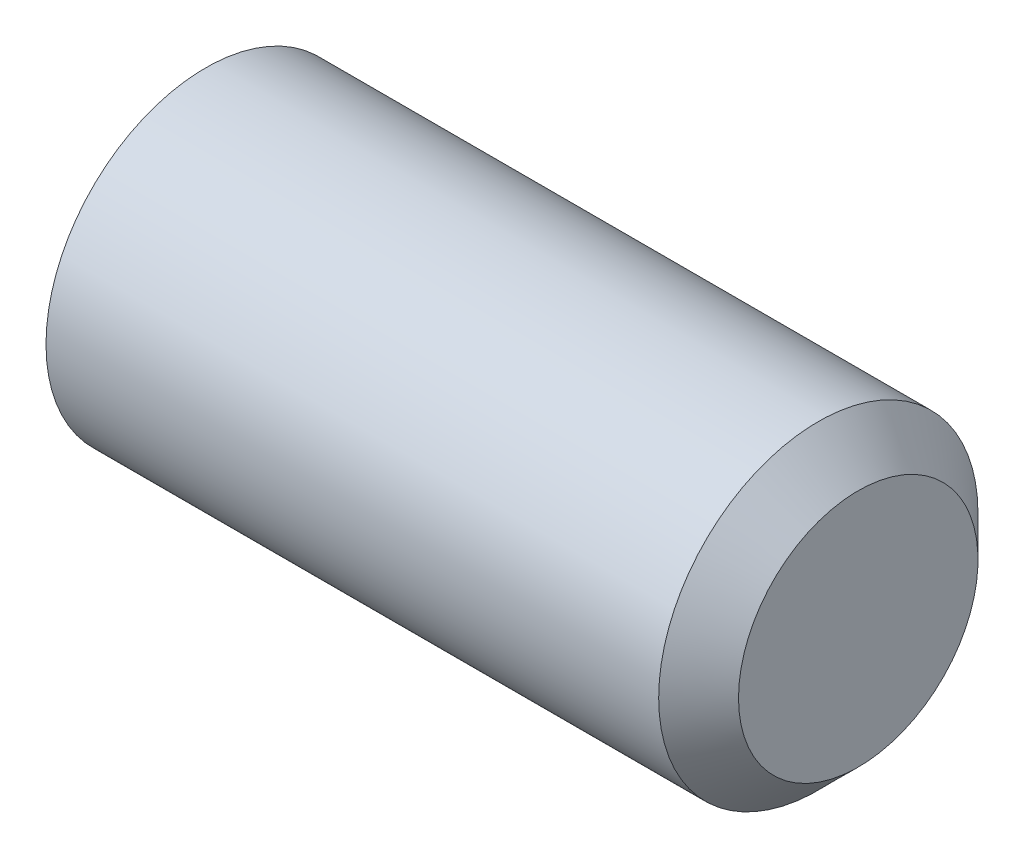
from build123d import *

# Parameters (mm, degrees)
HEX_2_DEPTH = 15


with BuildPart() as part:
    # BodySke → BaseBody (revolve)
    with BuildSketch(Plane.XY, mode=Mode.PRIVATE) as basebody_sk:
        Polygon((0, 0), (0, 10.352), (0.951473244, 12), (47, 12), (50, 9), (50, 0), align=None)
    revolve(basebody_sk.sketch.rotate(Axis((-12.7, 0, 0), (1, 0, 0)), 90), axis=Axis((-12.7, 0, 0), (1, 0, 0)))

    # Sketch2 → Hex 2 (cut)
    with BuildSketch(Plane.ZY):
        Polygon((3.464101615, 6), (-3.464101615, 6), (-6.92820323, 0), (-3.464101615, -6), (3.464101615, -6), (6.92820323, 0), align=None)
    extrude(amount=-HEX_2_DEPTH, mode=Mode.SUBTRACT)


solid = part.part
